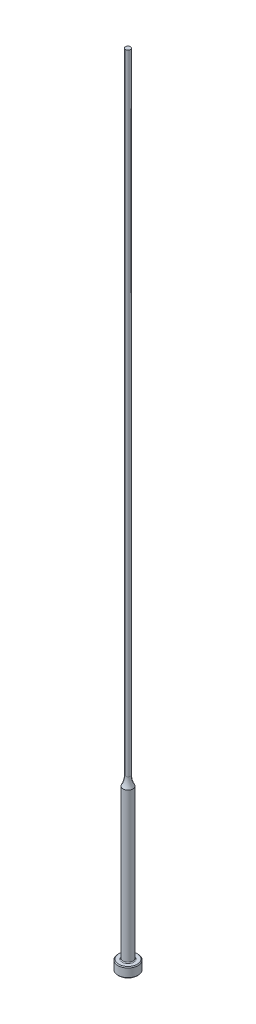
ISO-10303-21;
HEADER;
FILE_DESCRIPTION(('STEP AP214'),'2;1');
FILE_NAME('part.step','',(''),(''),'','','');
FILE_SCHEMA(('AUTOMOTIVE_DESIGN { 1 0 10303 214 1 1 1 1 }'));
ENDSEC;
DATA;
#1=APPLICATION_CONTEXT('core data for automotive mechanical design processes');
#2=APPLICATION_PROTOCOL_DEFINITION('international standard','automotive_design',2000,#1);
#3=PRODUCT_CONTEXT('',#1,'mechanical');
#4=PRODUCT('Part','Part','',(#3));
#5=PRODUCT_RELATED_PRODUCT_CATEGORY('part','',(#4));
#6=PRODUCT_DEFINITION_FORMATION('','',#4);
#7=PRODUCT_DEFINITION_CONTEXT('part definition',#1,'design');
#8=PRODUCT_DEFINITION('design','',#6,#7);
#9=PRODUCT_DEFINITION_SHAPE('','',#8);
#10=(LENGTH_UNIT() NAMED_UNIT(*) SI_UNIT(.MILLI.,.METRE.));
#11=(NAMED_UNIT(*) PLANE_ANGLE_UNIT() SI_UNIT($,.RADIAN.));
#12=(NAMED_UNIT(*) SI_UNIT($,.STERADIAN.) SOLID_ANGLE_UNIT());
#13=UNCERTAINTY_MEASURE_WITH_UNIT(LENGTH_MEASURE(1.E-05),#10,'distance_accuracy_value','');
#14=(GEOMETRIC_REPRESENTATION_CONTEXT(3) GLOBAL_UNCERTAINTY_ASSIGNED_CONTEXT((#13)) GLOBAL_UNIT_ASSIGNED_CONTEXT((#10,
#11,#12)) REPRESENTATION_CONTEXT('',''));
#15=CARTESIAN_POINT('',(0.,0.,0.));
#16=DIRECTION('',(0.,0.,1.));
#17=DIRECTION('',(1.,0.,0.));
#18=AXIS2_PLACEMENT_3D('',#15,#16,#17);
#19=CARTESIAN_POINT('',(-0.793749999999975,254.,0.));
#20=DIRECTION('',(0.,1.,0.));
#21=DIRECTION('',(0.,0.,1.));
#22=AXIS2_PLACEMENT_3D('',#19,#20,#21);
#23=PLANE('',#22);
#24=CARTESIAN_POINT('',(0.,254.,0.));
#25=DIRECTION('',(0.,1.,0.));
#26=DIRECTION('',(0.,0.,1.));
#27=AXIS2_PLACEMENT_3D('',#24,#25,#26);
#28=CIRCLE('',#27,0.793749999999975);
#29=CARTESIAN_POINT('',(0.,254.,0.793749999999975));
#30=VERTEX_POINT('',#29);
#31=EDGE_CURVE('E61',#30,#30,#28,.T.);
#32=ORIENTED_EDGE('',*,*,#31,.T.);
#33=EDGE_LOOP('',(#32));
#34=FACE_BOUND('',#33,.T.);
#35=ADVANCED_FACE('F35',(#34),#23,.T.);
#36=CARTESIAN_POINT('',(0.,259.958771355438,0.));
#37=DIRECTION('',(0.,1.,0.));
#38=DIRECTION('',(0.,0.,1.));
#39=AXIS2_PLACEMENT_3D('',#36,#37,#38);
#40=CYLINDRICAL_SURFACE('',#39,0.793749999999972);
#41=CARTESIAN_POINT('',(0.,53.8741805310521,0.));
#42=DIRECTION('',(0.,1.,0.));
#43=DIRECTION('',(0.,0.,1.));
#44=AXIS2_PLACEMENT_3D('',#41,#42,#43);
#45=CIRCLE('',#44,0.79374999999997);
#46=CARTESIAN_POINT('',(0.,53.8741805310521,0.79374999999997));
#47=VERTEX_POINT('',#46);
#48=EDGE_CURVE('E64',#47,#47,#45,.T.);
#49=ORIENTED_EDGE('',*,*,#48,.T.);
#50=EDGE_LOOP('',(#49));
#51=FACE_BOUND('',#50,.T.);
#52=ORIENTED_EDGE('',*,*,#31,.F.);
#53=EDGE_LOOP('',(#52));
#54=FACE_BOUND('',#53,.T.);
#55=ADVANCED_FACE('F84',(#51,#54),#40,.T.);
#56=CARTESIAN_POINT('',(0.,53.8741805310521,0.));
#57=DIRECTION('',(0.,1.,0.));
#58=DIRECTION('',(0.,0.,1.));
#59=AXIS2_PLACEMENT_3D('',#56,#57,#58);
#60=TOROIDAL_SURFACE('',#59,7.14374999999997,6.35);
#61=CARTESIAN_POINT('',(0.,50.8,0.));
#62=DIRECTION('',(0.,1.,0.));
#63=DIRECTION('',(0.,0.,1.));
#64=AXIS2_PLACEMENT_3D('',#61,#62,#63);
#65=CIRCLE('',#64,1.58749999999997);
#66=CARTESIAN_POINT('',(0.,50.8,1.58749999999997));
#67=VERTEX_POINT('',#66);
#68=EDGE_CURVE('E67',#67,#67,#65,.T.);
#69=ORIENTED_EDGE('',*,*,#68,.T.);
#70=EDGE_LOOP('',(#69));
#71=FACE_BOUND('',#70,.T.);
#72=ORIENTED_EDGE('',*,*,#48,.F.);
#73=EDGE_LOOP('',(#72));
#74=FACE_BOUND('',#73,.T.);
#75=ADVANCED_FACE('F71',(#71,#74),#60,.F.);
#76=CARTESIAN_POINT('',(0.,259.958771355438,0.));
#77=DIRECTION('',(0.,1.,0.));
#78=DIRECTION('',(0.,0.,1.));
#79=AXIS2_PLACEMENT_3D('',#76,#77,#78);
#80=CYLINDRICAL_SURFACE('',#79,1.58749999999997);
#81=CARTESIAN_POINT('',(0.,3.42900000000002,0.));
#82=DIRECTION('',(0.,1.,0.));
#83=DIRECTION('',(0.,0.,1.));
#84=AXIS2_PLACEMENT_3D('',#81,#82,#83);
#85=CIRCLE('',#84,1.58749999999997);
#86=CARTESIAN_POINT('',(0.,3.42900000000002,1.58749999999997));
#87=VERTEX_POINT('',#86);
#88=EDGE_CURVE('E42',#87,#87,#85,.T.);
#89=ORIENTED_EDGE('',*,*,#88,.T.);
#90=EDGE_LOOP('',(#89));
#91=FACE_BOUND('',#90,.T.);
#92=ORIENTED_EDGE('',*,*,#68,.F.);
#93=EDGE_LOOP('',(#92));
#94=FACE_BOUND('',#93,.T.);
#95=ADVANCED_FACE('F74',(#91,#94),#80,.T.);
#96=CARTESIAN_POINT('',(-3.17499999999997,3.175,0.));
#97=DIRECTION('',(0.,1.,0.));
#98=DIRECTION('',(0.,0.,1.));
#99=AXIS2_PLACEMENT_3D('',#96,#97,#98);
#100=PLANE('',#99);
#101=CARTESIAN_POINT('',(0.,3.175,0.));
#102=DIRECTION('',(0.,1.,0.));
#103=DIRECTION('',(0.,0.,1.));
#104=AXIS2_PLACEMENT_3D('',#101,#102,#103);
#105=CIRCLE('',#104,1.84149999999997);
#106=CARTESIAN_POINT('',(0.,3.175,1.84149999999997));
#107=VERTEX_POINT('',#106);
#108=EDGE_CURVE('E10',#107,#107,#105,.F.);
#109=ORIENTED_EDGE('',*,*,#108,.T.);
#110=EDGE_LOOP('',(#109));
#111=FACE_BOUND('',#110,.T.);
#112=CARTESIAN_POINT('',(0.,3.175,0.));
#113=DIRECTION('',(0.,1.,0.));
#114=DIRECTION('',(0.,0.,1.));
#115=AXIS2_PLACEMENT_3D('',#112,#113,#114);
#116=CIRCLE('',#115,2.92099999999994);
#117=CARTESIAN_POINT('',(0.,3.175,2.92099999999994));
#118=VERTEX_POINT('',#117);
#119=EDGE_CURVE('E58',#118,#118,#116,.T.);
#120=ORIENTED_EDGE('',*,*,#119,.T.);
#121=EDGE_LOOP('',(#120));
#122=FACE_BOUND('',#121,.T.);
#123=ADVANCED_FACE('F76',(#111,#122),#100,.T.);
#124=CARTESIAN_POINT('',(0.,259.958771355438,0.));
#125=DIRECTION('',(0.,1.,0.));
#126=DIRECTION('',(0.,0.,1.));
#127=AXIS2_PLACEMENT_3D('',#124,#125,#126);
#128=CYLINDRICAL_SURFACE('',#127,3.17499999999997);
#129=CARTESIAN_POINT('',(0.,2.92100000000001,0.));
#130=DIRECTION('',(0.,1.,0.));
#131=DIRECTION('',(0.,0.,1.));
#132=AXIS2_PLACEMENT_3D('',#129,#130,#131);
#133=CIRCLE('',#132,3.17499999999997);
#134=CARTESIAN_POINT('',(0.,2.92100000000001,3.17499999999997));
#135=VERTEX_POINT('',#134);
#136=EDGE_CURVE('E50',#135,#135,#133,.F.);
#137=ORIENTED_EDGE('',*,*,#136,.T.);
#138=EDGE_LOOP('',(#137));
#139=FACE_BOUND('',#138,.T.);
#140=CARTESIAN_POINT('',(0.,0.253999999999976,0.));
#141=DIRECTION('',(0.,-1.,0.));
#142=DIRECTION('',(0.,0.,-1.));
#143=AXIS2_PLACEMENT_3D('',#140,#141,#142);
#144=CIRCLE('',#143,3.17499999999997);
#145=CARTESIAN_POINT('',(0.,0.253999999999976,-3.17499999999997));
#146=VERTEX_POINT('',#145);
#147=EDGE_CURVE('E55',#146,#146,#144,.F.);
#148=ORIENTED_EDGE('',*,*,#147,.T.);
#149=EDGE_LOOP('',(#148));
#150=FACE_BOUND('',#149,.T.);
#151=ADVANCED_FACE('F82',(#139,#150),#128,.T.);
#152=CARTESIAN_POINT('',(0.,0.,0.));
#153=DIRECTION('',(0.,-1.,0.));
#154=DIRECTION('',(0.,0.,-1.));
#155=AXIS2_PLACEMENT_3D('',#152,#153,#154);
#156=PLANE('',#155);
#157=CARTESIAN_POINT('',(0.,0.,0.));
#158=DIRECTION('',(0.,-1.,0.));
#159=DIRECTION('',(0.,0.,-1.));
#160=AXIS2_PLACEMENT_3D('',#157,#158,#159);
#161=CIRCLE('',#160,2.92100000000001);
#162=CARTESIAN_POINT('',(0.,0.,-2.92100000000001));
#163=VERTEX_POINT('',#162);
#164=EDGE_CURVE('E46',#163,#163,#161,.T.);
#165=ORIENTED_EDGE('',*,*,#164,.T.);
#166=EDGE_LOOP('',(#165));
#167=FACE_BOUND('',#166,.T.);
#168=ADVANCED_FACE('F98',(#167),#156,.T.);
#169=CARTESIAN_POINT('',(0.,3.17499999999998,0.));
#170=DIRECTION('',(0.,-1.,0.));
#171=DIRECTION('',(0.,0.,-1.));
#172=AXIS2_PLACEMENT_3D('',#169,#170,#171);
#173=CONICAL_SURFACE('',#172,2.92099999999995,0.785398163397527);
#174=ORIENTED_EDGE('',*,*,#136,.F.);
#175=EDGE_LOOP('',(#174));
#176=FACE_BOUND('',#175,.T.);
#177=ORIENTED_EDGE('',*,*,#119,.F.);
#178=EDGE_LOOP('',(#177));
#179=FACE_BOUND('',#178,.T.);
#180=ADVANCED_FACE('F95',(#176,#179),#173,.T.);
#181=CARTESIAN_POINT('',(0.,0.253999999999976,0.));
#182=DIRECTION('',(0.,1.,0.));
#183=DIRECTION('',(0.,0.,1.));
#184=AXIS2_PLACEMENT_3D('',#181,#182,#183);
#185=CONICAL_SURFACE('',#184,3.17499999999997,0.785398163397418);
#186=ORIENTED_EDGE('',*,*,#164,.F.);
#187=EDGE_LOOP('',(#186));
#188=FACE_BOUND('',#187,.T.);
#189=ORIENTED_EDGE('',*,*,#147,.F.);
#190=EDGE_LOOP('',(#189));
#191=FACE_BOUND('',#190,.T.);
#192=ADVANCED_FACE('F97',(#188,#191),#185,.T.);
#193=CARTESIAN_POINT('',(0.,3.42900000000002,0.));
#194=DIRECTION('',(0.,1.,0.));
#195=DIRECTION('',(0.,0.,1.));
#196=AXIS2_PLACEMENT_3D('',#193,#194,#195);
#197=TOROIDAL_SURFACE('',#196,1.84149999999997,0.254);
#198=ORIENTED_EDGE('',*,*,#108,.F.);
#199=EDGE_LOOP('',(#198));
#200=FACE_BOUND('',#199,.T.);
#201=ORIENTED_EDGE('',*,*,#88,.F.);
#202=EDGE_LOOP('',(#201));
#203=FACE_BOUND('',#202,.T.);
#204=ADVANCED_FACE('F37',(#200,#203),#197,.F.);
#205=CLOSED_SHELL('',(#35,#55,#75,#95,#123,#151,#168,#180,#192,#204));
#206=MANIFOLD_SOLID_BREP('B2',#205);
#207=ADVANCED_BREP_SHAPE_REPRESENTATION('',(#18,#206),#14);
#208=SHAPE_DEFINITION_REPRESENTATION(#9,#207);
ENDSEC;
END-ISO-10303-21;
